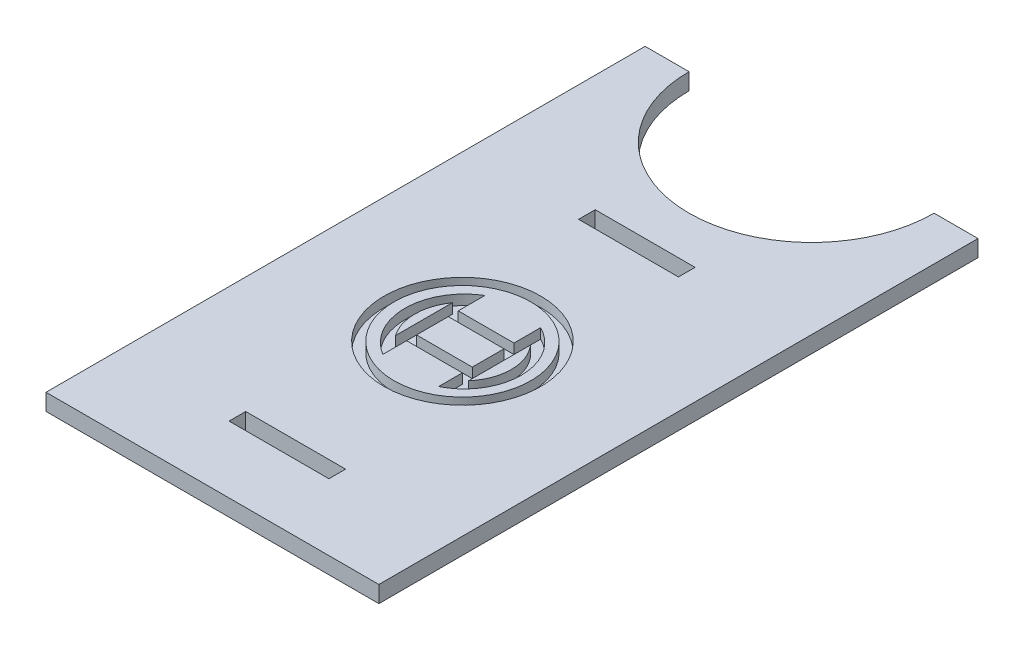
ISO-10303-21;
HEADER;
FILE_DESCRIPTION(('STEP AP214'),'2;1');
FILE_NAME('part.step','',(''),(''),'','','');
FILE_SCHEMA(('AUTOMOTIVE_DESIGN { 1 0 10303 214 1 1 1 1 }'));
ENDSEC;
DATA;
#1=APPLICATION_CONTEXT('core data for automotive mechanical design processes');
#2=APPLICATION_PROTOCOL_DEFINITION('international standard','automotive_design',2000,#1);
#3=PRODUCT_CONTEXT('',#1,'mechanical');
#4=PRODUCT('Part','Part','',(#3));
#5=PRODUCT_RELATED_PRODUCT_CATEGORY('part','',(#4));
#6=PRODUCT_DEFINITION_FORMATION('','',#4);
#7=PRODUCT_DEFINITION_CONTEXT('part definition',#1,'design');
#8=PRODUCT_DEFINITION('design','',#6,#7);
#9=PRODUCT_DEFINITION_SHAPE('','',#8);
#10=(LENGTH_UNIT() NAMED_UNIT(*) SI_UNIT(.MILLI.,.METRE.));
#11=(NAMED_UNIT(*) PLANE_ANGLE_UNIT() SI_UNIT($,.RADIAN.));
#12=(NAMED_UNIT(*) SI_UNIT($,.STERADIAN.) SOLID_ANGLE_UNIT());
#13=UNCERTAINTY_MEASURE_WITH_UNIT(LENGTH_MEASURE(1.E-05),#10,'distance_accuracy_value','');
#14=(GEOMETRIC_REPRESENTATION_CONTEXT(3) GLOBAL_UNCERTAINTY_ASSIGNED_CONTEXT((#13)) GLOBAL_UNIT_ASSIGNED_CONTEXT((#10,
#11,#12)) REPRESENTATION_CONTEXT('',''));
#15=CARTESIAN_POINT('',(0.,0.,0.));
#16=DIRECTION('',(0.,0.,1.));
#17=DIRECTION('',(1.,0.,0.));
#18=AXIS2_PLACEMENT_3D('',#15,#16,#17);
#19=CARTESIAN_POINT('',(0.,5.,0.));
#20=DIRECTION('',(0.,1.,0.));
#21=DIRECTION('',(0.,0.,1.));
#22=AXIS2_PLACEMENT_3D('',#19,#20,#21);
#23=PLANE('',#22);
#24=DIRECTION('',(0.,0.,-1.));
#25=VECTOR('',#24,1.);
#26=CARTESIAN_POINT('',(343.002887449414,5.,0.));
#27=LINE('',#26,#25);
#28=CARTESIAN_POINT('',(343.002887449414,5.,47.8009996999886));
#29=VERTEX_POINT('',#28);
#30=CARTESIAN_POINT('',(343.002887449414,5.,39.7884706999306));
#31=VERTEX_POINT('',#30);
#32=EDGE_CURVE('E322',#29,#31,#27,.T.);
#33=ORIENTED_EDGE('',*,*,#32,.T.);
#34=CARTESIAN_POINT('',(335.371279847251,5.,55.1167205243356));
#35=DIRECTION('',(0.,1.,0.));
#36=DIRECTION('',(0.,0.,1.));
#37=AXIS2_PLACEMENT_3D('',#34,#35,#36);
#38=CIRCLE('',#37,17.122986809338);
#39=CARTESIAN_POINT('',(343.002887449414,5.,70.4449703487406));
#40=VERTEX_POINT('',#39);
#41=EDGE_CURVE('E86',#31,#40,#38,.F.);
#42=ORIENTED_EDGE('',*,*,#41,.T.);
#43=DIRECTION('',(0.,0.,-1.));
#44=VECTOR('',#43,1.);
#45=CARTESIAN_POINT('',(343.002887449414,5.,0.));
#46=LINE('',#45,#44);
#47=CARTESIAN_POINT('',(343.002887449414,5.,63.3253491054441));
#48=VERTEX_POINT('',#47);
#49=EDGE_CURVE('E340',#40,#48,#46,.T.);
#50=ORIENTED_EDGE('',*,*,#49,.T.);
#51=DIRECTION('',(1.,0.,0.));
#52=VECTOR('',#51,1.);
#53=CARTESIAN_POINT('',(0.,5.,63.3253491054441));
#54=LINE('',#53,#52);
#55=CARTESIAN_POINT('',(326.260867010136,5.,63.3253491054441));
#56=VERTEX_POINT('',#55);
#57=EDGE_CURVE('E337',#56,#48,#54,.T.);
#58=ORIENTED_EDGE('',*,*,#57,.F.);
#59=DIRECTION('',(0.,0.,1.));
#60=VECTOR('',#59,1.);
#61=CARTESIAN_POINT('',(326.260867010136,5.,0.));
#62=LINE('',#61,#60);
#63=CARTESIAN_POINT('',(326.260867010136,5.,70.4449703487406));
#64=VERTEX_POINT('',#63);
#65=EDGE_CURVE('E334',#56,#64,#62,.T.);
#66=ORIENTED_EDGE('',*,*,#65,.T.);
#67=CARTESIAN_POINT('',(335.413171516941,5.,55.1167205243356));
#68=DIRECTION('',(0.,1.,0.));
#69=DIRECTION('',(0.,0.,1.));
#70=AXIS2_PLACEMENT_3D('',#67,#68,#69);
#71=CIRCLE('',#70,17.852728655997);
#72=CARTESIAN_POINT('',(326.260867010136,5.,39.7884706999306));
#73=VERTEX_POINT('',#72);
#74=EDGE_CURVE('E331',#73,#64,#71,.T.);
#75=ORIENTED_EDGE('',*,*,#74,.F.);
#76=DIRECTION('',(0.,0.,1.));
#77=VECTOR('',#76,1.);
#78=CARTESIAN_POINT('',(326.260867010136,5.,0.));
#79=LINE('',#78,#77);
#80=CARTESIAN_POINT('',(326.260867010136,5.,47.8009996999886));
#81=VERTEX_POINT('',#80);
#82=EDGE_CURVE('E328',#73,#81,#79,.T.);
#83=ORIENTED_EDGE('',*,*,#82,.T.);
#84=DIRECTION('',(1.,0.,0.));
#85=VECTOR('',#84,1.);
#86=CARTESIAN_POINT('',(0.,5.,47.8009996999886));
#87=LINE('',#86,#85);
#88=EDGE_CURVE('E325',#81,#29,#87,.T.);
#89=ORIENTED_EDGE('',*,*,#88,.T.);
#90=EDGE_LOOP('',(#33,#42,#50,#58,#66,#75,#83,#89));
#91=FACE_BOUND('',#90,.T.);
#92=CARTESIAN_POINT('',(334.807914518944,5.,55.0961913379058));
#93=DIRECTION('',(0.,1.,0.));
#94=DIRECTION('',(0.,0.,1.));
#95=AXIS2_PLACEMENT_3D('',#92,#93,#94);
#96=CIRCLE('',#95,20.5436076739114);
#97=CARTESIAN_POINT('',(334.807914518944,5.,75.6397990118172));
#98=VERTEX_POINT('',#97);
#99=EDGE_CURVE('E359',#98,#98,#96,.T.);
#100=ORIENTED_EDGE('',*,*,#99,.T.);
#101=EDGE_LOOP('',(#100));
#102=FACE_BOUND('',#101,.T.);
#103=ADVANCED_FACE('F61',(#91,#102),#23,.T.);
#104=CARTESIAN_POINT('',(0.,5.,-49.0936382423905));
#105=DIRECTION('',(0.,0.,-1.));
#106=DIRECTION('',(-1.,0.,0.));
#107=AXIS2_PLACEMENT_3D('',#104,#105,#106);
#108=PLANE('',#107);
#109=DIRECTION('',(1.,0.,0.));
#110=VECTOR('',#109,1.);
#111=CARTESIAN_POINT('',(0.,0.,-49.0936382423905));
#112=LINE('',#111,#110);
#113=CARTESIAN_POINT('',(372.331952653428,0.,-49.0936382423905));
#114=VERTEX_POINT('',#113);
#115=CARTESIAN_POINT('',(385.516384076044,0.,-49.0936382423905));
#116=VERTEX_POINT('',#115);
#117=EDGE_CURVE('E459',#114,#116,#112,.T.);
#118=ORIENTED_EDGE('',*,*,#117,.F.);
#119=DIRECTION('',(0.,-1.,0.));
#120=VECTOR('',#119,1.);
#121=CARTESIAN_POINT('',(372.331952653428,5.,-49.0936382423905));
#122=LINE('',#121,#120);
#123=CARTESIAN_POINT('',(372.331952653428,5.,-49.0936382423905));
#124=VERTEX_POINT('',#123);
#125=EDGE_CURVE('E12',#124,#114,#122,.T.);
#126=ORIENTED_EDGE('',*,*,#125,.F.);
#127=DIRECTION('',(1.,0.,0.));
#128=VECTOR('',#127,1.);
#129=CARTESIAN_POINT('',(0.,5.,-49.0936382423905));
#130=LINE('',#129,#128);
#131=CARTESIAN_POINT('',(385.516384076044,5.,-49.0936382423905));
#132=VERTEX_POINT('',#131);
#133=EDGE_CURVE('E422',#124,#132,#130,.T.);
#134=ORIENTED_EDGE('',*,*,#133,.T.);
#135=DIRECTION('',(0.,-1.,0.));
#136=VECTOR('',#135,1.);
#137=CARTESIAN_POINT('',(385.516384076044,5.,-49.0936382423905));
#138=LINE('',#137,#136);
#139=EDGE_CURVE('E476',#132,#116,#138,.T.);
#140=ORIENTED_EDGE('',*,*,#139,.T.);
#141=EDGE_LOOP('',(#118,#126,#134,#140));
#142=FACE_BOUND('',#141,.T.);
#143=ADVANCED_FACE('F541',(#142),#108,.T.);
#144=CARTESIAN_POINT('',(335.516384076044,5.,-49.0936382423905));
#145=DIRECTION('',(0.,-1.,0.));
#146=DIRECTION('',(0.,0.,-1.));
#147=AXIS2_PLACEMENT_3D('',#144,#145,#146);
#148=CYLINDRICAL_SURFACE('',#147,36.8155685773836);
#149=CARTESIAN_POINT('',(335.516384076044,0.,-49.0936382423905));
#150=DIRECTION('',(0.,1.,0.));
#151=DIRECTION('',(0.,0.,1.));
#152=AXIS2_PLACEMENT_3D('',#149,#150,#151);
#153=CIRCLE('',#152,36.8155685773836);
#154=CARTESIAN_POINT('',(298.700815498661,0.,-49.0936382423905));
#155=VERTEX_POINT('',#154);
#156=EDGE_CURVE('E462',#114,#155,#153,.F.);
#157=ORIENTED_EDGE('',*,*,#156,.T.);
#158=DIRECTION('',(0.,-1.,0.));
#159=VECTOR('',#158,1.);
#160=CARTESIAN_POINT('',(298.700815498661,5.,-49.0936382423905));
#161=LINE('',#160,#159);
#162=CARTESIAN_POINT('',(298.700815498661,5.,-49.0936382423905));
#163=VERTEX_POINT('',#162);
#164=EDGE_CURVE('E70',#163,#155,#161,.T.);
#165=ORIENTED_EDGE('',*,*,#164,.F.);
#166=CARTESIAN_POINT('',(335.516384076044,5.,-49.0936382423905));
#167=DIRECTION('',(0.,1.,0.));
#168=DIRECTION('',(0.,0.,1.));
#169=AXIS2_PLACEMENT_3D('',#166,#167,#168);
#170=CIRCLE('',#169,36.8155685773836);
#171=EDGE_CURVE('E425',#124,#163,#170,.F.);
#172=ORIENTED_EDGE('',*,*,#171,.F.);
#173=ORIENTED_EDGE('',*,*,#125,.T.);
#174=EDGE_LOOP('',(#157,#165,#172,#173));
#175=FACE_BOUND('',#174,.T.);
#176=ADVANCED_FACE('F544',(#175),#148,.F.);
#177=CARTESIAN_POINT('',(0.,5.,-49.0936382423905));
#178=DIRECTION('',(0.,0.,-1.));
#179=DIRECTION('',(-1.,0.,0.));
#180=AXIS2_PLACEMENT_3D('',#177,#178,#179);
#181=PLANE('',#180);
#182=DIRECTION('',(1.,0.,0.));
#183=VECTOR('',#182,1.);
#184=CARTESIAN_POINT('',(0.,0.,-49.0936382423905));
#185=LINE('',#184,#183);
#186=CARTESIAN_POINT('',(285.516384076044,0.,-49.0936382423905));
#187=VERTEX_POINT('',#186);
#188=EDGE_CURVE('E465',#187,#155,#185,.T.);
#189=ORIENTED_EDGE('',*,*,#188,.F.);
#190=DIRECTION('',(0.,-1.,0.));
#191=VECTOR('',#190,1.);
#192=CARTESIAN_POINT('',(285.516384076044,5.,-49.0936382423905));
#193=LINE('',#192,#191);
#194=CARTESIAN_POINT('',(285.516384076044,5.,-49.0936382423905));
#195=VERTEX_POINT('',#194);
#196=EDGE_CURVE('E484',#195,#187,#193,.T.);
#197=ORIENTED_EDGE('',*,*,#196,.F.);
#198=DIRECTION('',(1.,0.,0.));
#199=VECTOR('',#198,1.);
#200=CARTESIAN_POINT('',(0.,5.,-49.0936382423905));
#201=LINE('',#200,#199);
#202=EDGE_CURVE('E427',#195,#163,#201,.T.);
#203=ORIENTED_EDGE('',*,*,#202,.T.);
#204=ORIENTED_EDGE('',*,*,#164,.T.);
#205=EDGE_LOOP('',(#189,#197,#203,#204));
#206=FACE_BOUND('',#205,.T.);
#207=ADVANCED_FACE('F547',(#206),#181,.T.);
#208=CARTESIAN_POINT('',(285.516384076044,5.,0.));
#209=DIRECTION('',(-1.,0.,0.));
#210=DIRECTION('',(0.,0.,1.));
#211=AXIS2_PLACEMENT_3D('',#208,#209,#210);
#212=PLANE('',#211);
#213=DIRECTION('',(0.,0.,-1.));
#214=VECTOR('',#213,1.);
#215=CARTESIAN_POINT('',(285.516384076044,0.,0.));
#216=LINE('',#215,#214);
#217=CARTESIAN_POINT('',(285.516384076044,0.,130.90636175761));
#218=VERTEX_POINT('',#217);
#219=EDGE_CURVE('E468',#218,#187,#216,.T.);
#220=ORIENTED_EDGE('',*,*,#219,.F.);
#221=DIRECTION('',(0.,-1.,0.));
#222=VECTOR('',#221,1.);
#223=CARTESIAN_POINT('',(285.516384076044,5.,130.90636175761));
#224=LINE('',#223,#222);
#225=CARTESIAN_POINT('',(285.516384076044,5.,130.90636175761));
#226=VERTEX_POINT('',#225);
#227=EDGE_CURVE('E482',#226,#218,#224,.T.);
#228=ORIENTED_EDGE('',*,*,#227,.F.);
#229=DIRECTION('',(0.,0.,-1.));
#230=VECTOR('',#229,1.);
#231=CARTESIAN_POINT('',(285.516384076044,5.,0.));
#232=LINE('',#231,#230);
#233=EDGE_CURVE('E430',#226,#195,#232,.T.);
#234=ORIENTED_EDGE('',*,*,#233,.T.);
#235=ORIENTED_EDGE('',*,*,#196,.T.);
#236=EDGE_LOOP('',(#220,#228,#234,#235));
#237=FACE_BOUND('',#236,.T.);
#238=ADVANCED_FACE('F551',(#237),#212,.T.);
#239=CARTESIAN_POINT('',(0.,5.,130.90636175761));
#240=DIRECTION('',(0.,0.,-1.));
#241=DIRECTION('',(-1.,0.,0.));
#242=AXIS2_PLACEMENT_3D('',#239,#240,#241);
#243=PLANE('',#242);
#244=DIRECTION('',(1.,0.,0.));
#245=VECTOR('',#244,1.);
#246=CARTESIAN_POINT('',(0.,0.,130.90636175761));
#247=LINE('',#246,#245);
#248=CARTESIAN_POINT('',(385.516384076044,0.,130.90636175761));
#249=VERTEX_POINT('',#248);
#250=EDGE_CURVE('E471',#218,#249,#247,.T.);
#251=ORIENTED_EDGE('',*,*,#250,.T.);
#252=DIRECTION('',(0.,-1.,0.));
#253=VECTOR('',#252,1.);
#254=CARTESIAN_POINT('',(385.516384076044,5.,130.90636175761));
#255=LINE('',#254,#253);
#256=CARTESIAN_POINT('',(385.516384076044,5.,130.90636175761));
#257=VERTEX_POINT('',#256);
#258=EDGE_CURVE('E478',#257,#249,#255,.T.);
#259=ORIENTED_EDGE('',*,*,#258,.F.);
#260=DIRECTION('',(1.,0.,0.));
#261=VECTOR('',#260,1.);
#262=CARTESIAN_POINT('',(0.,5.,130.90636175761));
#263=LINE('',#262,#261);
#264=EDGE_CURVE('E433',#226,#257,#263,.T.);
#265=ORIENTED_EDGE('',*,*,#264,.F.);
#266=ORIENTED_EDGE('',*,*,#227,.T.);
#267=EDGE_LOOP('',(#251,#259,#265,#266));
#268=FACE_BOUND('',#267,.T.);
#269=ADVANCED_FACE('F556',(#268),#243,.F.);
#270=CARTESIAN_POINT('',(320.516384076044,5.,0.));
#271=DIRECTION('',(1.,0.,0.));
#272=DIRECTION('',(0.,0.,-1.));
#273=AXIS2_PLACEMENT_3D('',#270,#271,#272);
#274=PLANE('',#273);
#275=DIRECTION('',(0.,0.,1.));
#276=VECTOR('',#275,1.);
#277=CARTESIAN_POINT('',(320.516384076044,0.,0.));
#278=LINE('',#277,#276);
#279=CARTESIAN_POINT('',(320.516384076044,0.,105.90636175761));
#280=VERTEX_POINT('',#279);
#281=CARTESIAN_POINT('',(320.516384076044,0.,110.90636175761));
#282=VERTEX_POINT('',#281);
#283=EDGE_CURVE('E447',#280,#282,#278,.T.);
#284=ORIENTED_EDGE('',*,*,#283,.F.);
#285=DIRECTION('',(0.,-1.,0.));
#286=VECTOR('',#285,1.);
#287=CARTESIAN_POINT('',(320.516384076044,5.,105.90636175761));
#288=LINE('',#287,#286);
#289=CARTESIAN_POINT('',(320.516384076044,5.,105.90636175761));
#290=VERTEX_POINT('',#289);
#291=EDGE_CURVE('E479',#290,#280,#288,.T.);
#292=ORIENTED_EDGE('',*,*,#291,.F.);
#293=DIRECTION('',(0.,0.,1.));
#294=VECTOR('',#293,1.);
#295=CARTESIAN_POINT('',(320.516384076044,5.,0.));
#296=LINE('',#295,#294);
#297=CARTESIAN_POINT('',(320.516384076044,5.,110.90636175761));
#298=VERTEX_POINT('',#297);
#299=EDGE_CURVE('E410',#290,#298,#296,.T.);
#300=ORIENTED_EDGE('',*,*,#299,.T.);
#301=DIRECTION('',(0.,-1.,0.));
#302=VECTOR('',#301,1.);
#303=CARTESIAN_POINT('',(320.516384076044,5.,110.90636175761));
#304=LINE('',#303,#302);
#305=EDGE_CURVE('E487',#298,#282,#304,.T.);
#306=ORIENTED_EDGE('',*,*,#305,.T.);
#307=EDGE_LOOP('',(#284,#292,#300,#306));
#308=FACE_BOUND('',#307,.T.);
#309=ADVANCED_FACE('F863',(#308),#274,.T.);
#310=CARTESIAN_POINT('',(0.,5.,105.90636175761));
#311=DIRECTION('',(0.,0.,1.));
#312=DIRECTION('',(1.,0.,0.));
#313=AXIS2_PLACEMENT_3D('',#310,#311,#312);
#314=PLANE('',#313);
#315=DIRECTION('',(-1.,0.,0.));
#316=VECTOR('',#315,1.);
#317=CARTESIAN_POINT('',(0.,0.,105.90636175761));
#318=LINE('',#317,#316);
#319=CARTESIAN_POINT('',(350.516384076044,0.,105.90636175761));
#320=VERTEX_POINT('',#319);
#321=EDGE_CURVE('E450',#320,#280,#318,.T.);
#322=ORIENTED_EDGE('',*,*,#321,.F.);
#323=DIRECTION('',(0.,-1.,0.));
#324=VECTOR('',#323,1.);
#325=CARTESIAN_POINT('',(350.516384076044,5.,105.90636175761));
#326=LINE('',#325,#324);
#327=CARTESIAN_POINT('',(350.516384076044,5.,105.90636175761));
#328=VERTEX_POINT('',#327);
#329=EDGE_CURVE('E491',#328,#320,#326,.T.);
#330=ORIENTED_EDGE('',*,*,#329,.F.);
#331=DIRECTION('',(-1.,0.,0.));
#332=VECTOR('',#331,1.);
#333=CARTESIAN_POINT('',(0.,5.,105.90636175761));
#334=LINE('',#333,#332);
#335=EDGE_CURVE('E413',#328,#290,#334,.T.);
#336=ORIENTED_EDGE('',*,*,#335,.T.);
#337=ORIENTED_EDGE('',*,*,#291,.T.);
#338=EDGE_LOOP('',(#322,#330,#336,#337));
#339=FACE_BOUND('',#338,.T.);
#340=ADVANCED_FACE('F855',(#339),#314,.T.);
#341=CARTESIAN_POINT('',(350.516384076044,5.,0.));
#342=DIRECTION('',(-1.,0.,0.));
#343=DIRECTION('',(0.,0.,1.));
#344=AXIS2_PLACEMENT_3D('',#341,#342,#343);
#345=PLANE('',#344);
#346=DIRECTION('',(0.,0.,-1.));
#347=VECTOR('',#346,1.);
#348=CARTESIAN_POINT('',(350.516384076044,0.,0.));
#349=LINE('',#348,#347);
#350=CARTESIAN_POINT('',(350.516384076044,0.,110.90636175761));
#351=VERTEX_POINT('',#350);
#352=EDGE_CURVE('E453',#351,#320,#349,.T.);
#353=ORIENTED_EDGE('',*,*,#352,.F.);
#354=DIRECTION('',(0.,-1.,0.));
#355=VECTOR('',#354,1.);
#356=CARTESIAN_POINT('',(350.516384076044,5.,110.90636175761));
#357=LINE('',#356,#355);
#358=CARTESIAN_POINT('',(350.516384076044,5.,110.90636175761));
#359=VERTEX_POINT('',#358);
#360=EDGE_CURVE('E489',#359,#351,#357,.T.);
#361=ORIENTED_EDGE('',*,*,#360,.F.);
#362=DIRECTION('',(0.,0.,-1.));
#363=VECTOR('',#362,1.);
#364=CARTESIAN_POINT('',(350.516384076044,5.,0.));
#365=LINE('',#364,#363);
#366=EDGE_CURVE('E416',#359,#328,#365,.T.);
#367=ORIENTED_EDGE('',*,*,#366,.T.);
#368=ORIENTED_EDGE('',*,*,#329,.T.);
#369=EDGE_LOOP('',(#353,#361,#367,#368));
#370=FACE_BOUND('',#369,.T.);
#371=ADVANCED_FACE('F849',(#370),#345,.T.);
#372=CARTESIAN_POINT('',(320.516384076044,5.,0.));
#373=DIRECTION('',(-1.,0.,0.));
#374=DIRECTION('',(0.,0.,1.));
#375=AXIS2_PLACEMENT_3D('',#372,#373,#374);
#376=PLANE('',#375);
#377=DIRECTION('',(0.,0.,-1.));
#378=VECTOR('',#377,1.);
#379=CARTESIAN_POINT('',(320.516384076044,0.,0.));
#380=LINE('',#379,#378);
#381=CARTESIAN_POINT('',(320.516384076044,0.,5.90636175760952));
#382=VERTEX_POINT('',#381);
#383=CARTESIAN_POINT('',(320.516384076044,0.,0.906361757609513));
#384=VERTEX_POINT('',#383);
#385=EDGE_CURVE('E395',#382,#384,#380,.T.);
#386=ORIENTED_EDGE('',*,*,#385,.T.);
#387=DIRECTION('',(0.,-1.,0.));
#388=VECTOR('',#387,1.);
#389=CARTESIAN_POINT('',(320.516384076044,5.,0.906361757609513));
#390=LINE('',#389,#388);
#391=CARTESIAN_POINT('',(320.516384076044,5.,0.906361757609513));
#392=VERTEX_POINT('',#391);
#393=EDGE_CURVE('E65',#392,#384,#390,.T.);
#394=ORIENTED_EDGE('',*,*,#393,.F.);
#395=DIRECTION('',(0.,0.,-1.));
#396=VECTOR('',#395,1.);
#397=CARTESIAN_POINT('',(320.516384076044,5.,0.));
#398=LINE('',#397,#396);
#399=CARTESIAN_POINT('',(320.516384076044,5.,5.90636175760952));
#400=VERTEX_POINT('',#399);
#401=EDGE_CURVE('E400',#400,#392,#398,.T.);
#402=ORIENTED_EDGE('',*,*,#401,.F.);
#403=DIRECTION('',(0.,-1.,0.));
#404=VECTOR('',#403,1.);
#405=CARTESIAN_POINT('',(320.516384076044,5.,5.90636175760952));
#406=LINE('',#405,#404);
#407=EDGE_CURVE('E438',#400,#382,#406,.T.);
#408=ORIENTED_EDGE('',*,*,#407,.T.);
#409=EDGE_LOOP('',(#386,#394,#402,#408));
#410=FACE_BOUND('',#409,.T.);
#411=ADVANCED_FACE('F63',(#410),#376,.F.);
#412=CARTESIAN_POINT('',(0.,5.,0.906361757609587));
#413=DIRECTION('',(0.,0.,-1.));
#414=DIRECTION('',(-1.,0.,0.));
#415=AXIS2_PLACEMENT_3D('',#412,#413,#414);
#416=PLANE('',#415);
#417=DIRECTION('',(1.,0.,0.));
#418=VECTOR('',#417,1.);
#419=CARTESIAN_POINT('',(0.,0.,0.906361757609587));
#420=LINE('',#419,#418);
#421=CARTESIAN_POINT('',(350.516384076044,0.,0.906361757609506));
#422=VERTEX_POINT('',#421);
#423=EDGE_CURVE('E441',#384,#422,#420,.T.);
#424=ORIENTED_EDGE('',*,*,#423,.T.);
#425=DIRECTION('',(0.,-1.,0.));
#426=VECTOR('',#425,1.);
#427=CARTESIAN_POINT('',(350.516384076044,5.,0.906361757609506));
#428=LINE('',#427,#426);
#429=CARTESIAN_POINT('',(350.516384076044,5.,0.906361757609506));
#430=VERTEX_POINT('',#429);
#431=EDGE_CURVE('E498',#430,#422,#428,.T.);
#432=ORIENTED_EDGE('',*,*,#431,.F.);
#433=DIRECTION('',(1.,0.,0.));
#434=VECTOR('',#433,1.);
#435=CARTESIAN_POINT('',(0.,5.,0.906361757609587));
#436=LINE('',#435,#434);
#437=EDGE_CURVE('E403',#392,#430,#436,.T.);
#438=ORIENTED_EDGE('',*,*,#437,.F.);
#439=ORIENTED_EDGE('',*,*,#393,.T.);
#440=EDGE_LOOP('',(#424,#432,#438,#439));
#441=FACE_BOUND('',#440,.T.);
#442=ADVANCED_FACE('F507',(#441),#416,.F.);
#443=CARTESIAN_POINT('',(350.516384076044,5.,0.));
#444=DIRECTION('',(1.,0.,0.));
#445=DIRECTION('',(0.,0.,-1.));
#446=AXIS2_PLACEMENT_3D('',#443,#444,#445);
#447=PLANE('',#446);
#448=DIRECTION('',(0.,0.,1.));
#449=VECTOR('',#448,1.);
#450=CARTESIAN_POINT('',(350.516384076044,0.,0.));
#451=LINE('',#450,#449);
#452=CARTESIAN_POINT('',(350.516384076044,0.,5.90636175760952));
#453=VERTEX_POINT('',#452);
#454=EDGE_CURVE('E443',#422,#453,#451,.T.);
#455=ORIENTED_EDGE('',*,*,#454,.T.);
#456=DIRECTION('',(0.,-1.,0.));
#457=VECTOR('',#456,1.);
#458=CARTESIAN_POINT('',(350.516384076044,5.,5.90636175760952));
#459=LINE('',#458,#457);
#460=CARTESIAN_POINT('',(350.516384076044,5.,5.90636175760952));
#461=VERTEX_POINT('',#460);
#462=EDGE_CURVE('E496',#461,#453,#459,.T.);
#463=ORIENTED_EDGE('',*,*,#462,.F.);
#464=DIRECTION('',(0.,0.,1.));
#465=VECTOR('',#464,1.);
#466=CARTESIAN_POINT('',(350.516384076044,5.,0.));
#467=LINE('',#466,#465);
#468=EDGE_CURVE('E406',#430,#461,#467,.T.);
#469=ORIENTED_EDGE('',*,*,#468,.F.);
#470=ORIENTED_EDGE('',*,*,#431,.T.);
#471=EDGE_LOOP('',(#455,#463,#469,#470));
#472=FACE_BOUND('',#471,.T.);
#473=ADVANCED_FACE('F517',(#472),#447,.F.);
#474=CARTESIAN_POINT('',(0.,5.,110.90636175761));
#475=DIRECTION('',(0.,0.,-1.));
#476=DIRECTION('',(-1.,0.,0.));
#477=AXIS2_PLACEMENT_3D('',#474,#475,#476);
#478=PLANE('',#477);
#479=DIRECTION('',(1.,0.,0.));
#480=VECTOR('',#479,1.);
#481=CARTESIAN_POINT('',(0.,0.,110.90636175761));
#482=LINE('',#481,#480);
#483=EDGE_CURVE('E456',#282,#351,#482,.T.);
#484=ORIENTED_EDGE('',*,*,#483,.F.);
#485=ORIENTED_EDGE('',*,*,#305,.F.);
#486=DIRECTION('',(1.,0.,0.));
#487=VECTOR('',#486,1.);
#488=CARTESIAN_POINT('',(0.,5.,110.90636175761));
#489=LINE('',#488,#487);
#490=EDGE_CURVE('E419',#298,#359,#489,.T.);
#491=ORIENTED_EDGE('',*,*,#490,.T.);
#492=ORIENTED_EDGE('',*,*,#360,.T.);
#493=EDGE_LOOP('',(#484,#485,#491,#492));
#494=FACE_BOUND('',#493,.T.);
#495=ADVANCED_FACE('F824',(#494),#478,.T.);
#496=CARTESIAN_POINT('',(0.,5.,5.90636175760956));
#497=DIRECTION('',(0.,0.,1.));
#498=DIRECTION('',(1.,0.,0.));
#499=AXIS2_PLACEMENT_3D('',#496,#497,#498);
#500=PLANE('',#499);
#501=DIRECTION('',(-1.,0.,0.));
#502=VECTOR('',#501,1.);
#503=CARTESIAN_POINT('',(0.,0.,5.90636175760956));
#504=LINE('',#503,#502);
#505=EDGE_CURVE('E445',#453,#382,#504,.T.);
#506=ORIENTED_EDGE('',*,*,#505,.T.);
#507=ORIENTED_EDGE('',*,*,#407,.F.);
#508=DIRECTION('',(-1.,0.,0.));
#509=VECTOR('',#508,1.);
#510=CARTESIAN_POINT('',(0.,5.,5.90636175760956));
#511=LINE('',#510,#509);
#512=EDGE_CURVE('E408',#461,#400,#511,.T.);
#513=ORIENTED_EDGE('',*,*,#512,.F.);
#514=ORIENTED_EDGE('',*,*,#462,.T.);
#515=EDGE_LOOP('',(#506,#507,#513,#514));
#516=FACE_BOUND('',#515,.T.);
#517=ADVANCED_FACE('F520',(#516),#500,.F.);
#518=CARTESIAN_POINT('',(385.516384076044,5.,0.));
#519=DIRECTION('',(-1.,0.,0.));
#520=DIRECTION('',(0.,0.,1.));
#521=AXIS2_PLACEMENT_3D('',#518,#519,#520);
#522=PLANE('',#521);
#523=DIRECTION('',(0.,0.,-1.));
#524=VECTOR('',#523,1.);
#525=CARTESIAN_POINT('',(385.516384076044,0.,0.));
#526=LINE('',#525,#524);
#527=EDGE_CURVE('E404',#249,#116,#526,.T.);
#528=ORIENTED_EDGE('',*,*,#527,.T.);
#529=ORIENTED_EDGE('',*,*,#139,.F.);
#530=DIRECTION('',(0.,0.,-1.));
#531=VECTOR('',#530,1.);
#532=CARTESIAN_POINT('',(385.516384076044,5.,0.));
#533=LINE('',#532,#531);
#534=EDGE_CURVE('E436',#257,#132,#533,.T.);
#535=ORIENTED_EDGE('',*,*,#534,.F.);
#536=ORIENTED_EDGE('',*,*,#258,.T.);
#537=EDGE_LOOP('',(#528,#529,#535,#536));
#538=FACE_BOUND('',#537,.T.);
#539=ADVANCED_FACE('F525',(#538),#522,.F.);
#540=CARTESIAN_POINT('',(334.807914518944,5.,55.0961913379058));
#541=DIRECTION('',(0.,1.,0.));
#542=DIRECTION('',(0.,0.,1.));
#543=AXIS2_PLACEMENT_3D('',#540,#541,#542);
#544=CIRCLE('',#543,23.5436076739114);
#545=CARTESIAN_POINT('',(334.807914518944,5.,78.6397990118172));
#546=VERTEX_POINT('',#545);
#547=EDGE_CURVE('E392',#546,#546,#544,.T.);
#548=ORIENTED_EDGE('',*,*,#547,.F.);
#549=EDGE_LOOP('',(#548));
#550=FACE_BOUND('',#549,.T.);
#551=ORIENTED_EDGE('',*,*,#401,.T.);
#552=ORIENTED_EDGE('',*,*,#437,.T.);
#553=ORIENTED_EDGE('',*,*,#468,.T.);
#554=ORIENTED_EDGE('',*,*,#512,.T.);
#555=EDGE_LOOP('',(#551,#552,#553,#554));
#556=FACE_BOUND('',#555,.T.);
#557=ORIENTED_EDGE('',*,*,#299,.F.);
#558=ORIENTED_EDGE('',*,*,#335,.F.);
#559=ORIENTED_EDGE('',*,*,#366,.F.);
#560=ORIENTED_EDGE('',*,*,#490,.F.);
#561=EDGE_LOOP('',(#557,#558,#559,#560));
#562=FACE_BOUND('',#561,.T.);
#563=ORIENTED_EDGE('',*,*,#133,.F.);
#564=ORIENTED_EDGE('',*,*,#171,.T.);
#565=ORIENTED_EDGE('',*,*,#202,.F.);
#566=ORIENTED_EDGE('',*,*,#233,.F.);
#567=ORIENTED_EDGE('',*,*,#264,.T.);
#568=ORIENTED_EDGE('',*,*,#534,.T.);
#569=EDGE_LOOP('',(#563,#564,#565,#566,#567,#568));
#570=FACE_BOUND('',#569,.T.);
#571=ADVANCED_FACE('F522',(#550,#556,#562,#570),#23,.T.);
#572=CARTESIAN_POINT('',(0.,0.,0.));
#573=DIRECTION('',(0.,1.,0.));
#574=DIRECTION('',(0.,0.,1.));
#575=AXIS2_PLACEMENT_3D('',#572,#573,#574);
#576=PLANE('',#575);
#577=ORIENTED_EDGE('',*,*,#385,.F.);
#578=ORIENTED_EDGE('',*,*,#505,.F.);
#579=ORIENTED_EDGE('',*,*,#454,.F.);
#580=ORIENTED_EDGE('',*,*,#423,.F.);
#581=EDGE_LOOP('',(#577,#578,#579,#580));
#582=FACE_BOUND('',#581,.T.);
#583=ORIENTED_EDGE('',*,*,#283,.T.);
#584=ORIENTED_EDGE('',*,*,#483,.T.);
#585=ORIENTED_EDGE('',*,*,#352,.T.);
#586=ORIENTED_EDGE('',*,*,#321,.T.);
#587=EDGE_LOOP('',(#583,#584,#585,#586));
#588=FACE_BOUND('',#587,.T.);
#589=ORIENTED_EDGE('',*,*,#117,.T.);
#590=ORIENTED_EDGE('',*,*,#527,.F.);
#591=ORIENTED_EDGE('',*,*,#250,.F.);
#592=ORIENTED_EDGE('',*,*,#219,.T.);
#593=ORIENTED_EDGE('',*,*,#188,.T.);
#594=ORIENTED_EDGE('',*,*,#156,.F.);
#595=EDGE_LOOP('',(#589,#590,#591,#592,#593,#594));
#596=FACE_BOUND('',#595,.T.);
#597=ADVANCED_FACE('F514',(#582,#588,#596),#576,.F.);
#598=CARTESIAN_POINT('',(334.807914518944,2.,55.0961913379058));
#599=DIRECTION('',(0.,1.,0.));
#600=DIRECTION('',(0.,0.,1.));
#601=AXIS2_PLACEMENT_3D('',#598,#599,#600);
#602=CYLINDRICAL_SURFACE('',#601,20.5436076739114);
#603=CARTESIAN_POINT('',(334.807914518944,2.,55.0961913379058));
#604=DIRECTION('',(0.,1.,0.));
#605=DIRECTION('',(0.,0.,1.));
#606=AXIS2_PLACEMENT_3D('',#603,#604,#605);
#607=CIRCLE('',#606,20.5436076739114);
#608=CARTESIAN_POINT('',(334.807914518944,2.,75.6397990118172));
#609=VERTEX_POINT('',#608);
#610=EDGE_CURVE('E388',#609,#609,#607,.T.);
#611=ORIENTED_EDGE('',*,*,#610,.T.);
#612=EDGE_LOOP('',(#611));
#613=FACE_BOUND('',#612,.T.);
#614=ORIENTED_EDGE('',*,*,#99,.F.);
#615=EDGE_LOOP('',(#614));
#616=FACE_BOUND('',#615,.T.);
#617=ADVANCED_FACE('F560',(#613,#616),#602,.T.);
#618=CARTESIAN_POINT('',(334.807914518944,2.,55.0961913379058));
#619=DIRECTION('',(0.,1.,0.));
#620=DIRECTION('',(0.,0.,1.));
#621=AXIS2_PLACEMENT_3D('',#618,#619,#620);
#622=CYLINDRICAL_SURFACE('',#621,23.5436076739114);
#623=CARTESIAN_POINT('',(334.807914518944,2.,55.0961913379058));
#624=DIRECTION('',(0.,1.,0.));
#625=DIRECTION('',(0.,0.,1.));
#626=AXIS2_PLACEMENT_3D('',#623,#624,#625);
#627=CIRCLE('',#626,23.5436076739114);
#628=CARTESIAN_POINT('',(334.807914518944,2.,78.6397990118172));
#629=VERTEX_POINT('',#628);
#630=EDGE_CURVE('E391',#629,#629,#627,.T.);
#631=ORIENTED_EDGE('',*,*,#630,.F.);
#632=EDGE_LOOP('',(#631));
#633=FACE_BOUND('',#632,.T.);
#634=ORIENTED_EDGE('',*,*,#547,.T.);
#635=EDGE_LOOP('',(#634));
#636=FACE_BOUND('',#635,.T.);
#637=ADVANCED_FACE('F565',(#633,#636),#622,.F.);
#638=CARTESIAN_POINT('',(0.,2.,0.));
#639=DIRECTION('',(0.,1.,0.));
#640=DIRECTION('',(0.,0.,1.));
#641=AXIS2_PLACEMENT_3D('',#638,#639,#640);
#642=PLANE('',#641);
#643=ORIENTED_EDGE('',*,*,#610,.F.);
#644=EDGE_LOOP('',(#643));
#645=FACE_BOUND('',#644,.T.);
#646=ORIENTED_EDGE('',*,*,#630,.T.);
#647=EDGE_LOOP('',(#646));
#648=FACE_BOUND('',#647,.T.);
#649=ADVANCED_FACE('F652',(#645,#648),#642,.T.);
#650=CARTESIAN_POINT('',(346.002887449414,2.,0.));
#651=DIRECTION('',(1.,0.,0.));
#652=DIRECTION('',(0.,0.,-1.));
#653=AXIS2_PLACEMENT_3D('',#650,#651,#652);
#654=PLANE('',#653);
#655=DIRECTION('',(0.,0.,-1.));
#656=VECTOR('',#655,1.);
#657=CARTESIAN_POINT('',(346.002887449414,5.,0.));
#658=LINE('',#657,#656);
#659=CARTESIAN_POINT('',(346.002887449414,5.,64.4133691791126));
#660=VERTEX_POINT('',#659);
#661=CARTESIAN_POINT('',(346.002887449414,5.,45.8200718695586));
#662=VERTEX_POINT('',#661);
#663=EDGE_CURVE('E353',#660,#662,#658,.T.);
#664=ORIENTED_EDGE('',*,*,#663,.T.);
#665=DIRECTION('',(0.,1.,0.));
#666=VECTOR('',#665,1.);
#667=CARTESIAN_POINT('',(346.002887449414,2.,45.8200718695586));
#668=LINE('',#667,#666);
#669=CARTESIAN_POINT('',(346.002887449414,2.,45.8200718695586));
#670=VERTEX_POINT('',#669);
#671=EDGE_CURVE('E360',#670,#662,#668,.T.);
#672=ORIENTED_EDGE('',*,*,#671,.F.);
#673=DIRECTION('',(0.,0.,-1.));
#674=VECTOR('',#673,1.);
#675=CARTESIAN_POINT('',(346.002887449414,2.,0.));
#676=LINE('',#675,#674);
#677=CARTESIAN_POINT('',(346.002887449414,2.,64.4133691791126));
#678=VERTEX_POINT('',#677);
#679=EDGE_CURVE('E313',#678,#670,#676,.T.);
#680=ORIENTED_EDGE('',*,*,#679,.F.);
#681=DIRECTION('',(0.,1.,0.));
#682=VECTOR('',#681,1.);
#683=CARTESIAN_POINT('',(346.002887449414,2.,64.4133691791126));
#684=LINE('',#683,#682);
#685=EDGE_CURVE('E357',#678,#660,#684,.T.);
#686=ORIENTED_EDGE('',*,*,#685,.T.);
#687=EDGE_LOOP('',(#664,#672,#680,#686));
#688=FACE_BOUND('',#687,.T.);
#689=ADVANCED_FACE('F620',(#688),#654,.F.);
#690=CARTESIAN_POINT('',(343.002887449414,2.,0.));
#691=DIRECTION('',(1.,0.,0.));
#692=DIRECTION('',(0.,0.,-1.));
#693=AXIS2_PLACEMENT_3D('',#690,#691,#692);
#694=PLANE('',#693);
#695=DIRECTION('',(0.,0.,-1.));
#696=VECTOR('',#695,1.);
#697=CARTESIAN_POINT('',(343.002887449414,5.,0.));
#698=LINE('',#697,#696);
#699=CARTESIAN_POINT('',(343.002887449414,5.,60.3253491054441));
#700=VERTEX_POINT('',#699);
#701=CARTESIAN_POINT('',(343.002887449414,5.,50.8009996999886));
#702=VERTEX_POINT('',#701);
#703=EDGE_CURVE('E78',#700,#702,#698,.T.);
#704=ORIENTED_EDGE('',*,*,#703,.F.);
#705=DIRECTION('',(0.,1.,0.));
#706=VECTOR('',#705,1.);
#707=CARTESIAN_POINT('',(343.002887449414,2.,60.3253491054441));
#708=LINE('',#707,#706);
#709=CARTESIAN_POINT('',(343.002887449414,2.,60.3253491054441));
#710=VERTEX_POINT('',#709);
#711=EDGE_CURVE('E369',#710,#700,#708,.T.);
#712=ORIENTED_EDGE('',*,*,#711,.F.);
#713=DIRECTION('',(0.,0.,-1.));
#714=VECTOR('',#713,1.);
#715=CARTESIAN_POINT('',(343.002887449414,2.,0.));
#716=LINE('',#715,#714);
#717=CARTESIAN_POINT('',(343.002887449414,2.,50.8009996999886));
#718=VERTEX_POINT('',#717);
#719=EDGE_CURVE('E304',#710,#718,#716,.T.);
#720=ORIENTED_EDGE('',*,*,#719,.T.);
#721=DIRECTION('',(0.,1.,0.));
#722=VECTOR('',#721,1.);
#723=CARTESIAN_POINT('',(343.002887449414,2.,50.8009996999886));
#724=LINE('',#723,#722);
#725=EDGE_CURVE('E363',#718,#702,#724,.T.);
#726=ORIENTED_EDGE('',*,*,#725,.T.);
#727=EDGE_LOOP('',(#704,#712,#720,#726));
#728=FACE_BOUND('',#727,.T.);
#729=ADVANCED_FACE('F593',(#728),#694,.T.);
#730=CARTESIAN_POINT('',(0.,2.,50.8009996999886));
#731=DIRECTION('',(0.,0.,1.));
#732=DIRECTION('',(1.,0.,0.));
#733=AXIS2_PLACEMENT_3D('',#730,#731,#732);
#734=PLANE('',#733);
#735=DIRECTION('',(1.,0.,0.));
#736=VECTOR('',#735,1.);
#737=CARTESIAN_POINT('',(0.,5.,50.8009996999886));
#738=LINE('',#737,#736);
#739=CARTESIAN_POINT('',(326.260867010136,5.,50.8009996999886));
#740=VERTEX_POINT('',#739);
#741=EDGE_CURVE('E350',#740,#702,#738,.T.);
#742=ORIENTED_EDGE('',*,*,#741,.T.);
#743=ORIENTED_EDGE('',*,*,#725,.F.);
#744=DIRECTION('',(1.,0.,0.));
#745=VECTOR('',#744,1.);
#746=CARTESIAN_POINT('',(0.,2.,50.8009996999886));
#747=LINE('',#746,#745);
#748=CARTESIAN_POINT('',(326.260867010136,2.,50.8009996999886));
#749=VERTEX_POINT('',#748);
#750=EDGE_CURVE('E310',#749,#718,#747,.T.);
#751=ORIENTED_EDGE('',*,*,#750,.F.);
#752=DIRECTION('',(0.,1.,0.));
#753=VECTOR('',#752,1.);
#754=CARTESIAN_POINT('',(326.260867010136,2.,50.8009996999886));
#755=LINE('',#754,#753);
#756=EDGE_CURVE('E365',#749,#740,#755,.T.);
#757=ORIENTED_EDGE('',*,*,#756,.T.);
#758=EDGE_LOOP('',(#742,#743,#751,#757));
#759=FACE_BOUND('',#758,.T.);
#760=ADVANCED_FACE('F600',(#759),#734,.F.);
#761=CARTESIAN_POINT('',(326.260867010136,2.,0.));
#762=DIRECTION('',(-1.,0.,0.));
#763=DIRECTION('',(0.,0.,1.));
#764=AXIS2_PLACEMENT_3D('',#761,#762,#763);
#765=PLANE('',#764);
#766=DIRECTION('',(0.,0.,1.));
#767=VECTOR('',#766,1.);
#768=CARTESIAN_POINT('',(326.260867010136,5.,0.));
#769=LINE('',#768,#767);
#770=CARTESIAN_POINT('',(326.260867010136,5.,60.3253491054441));
#771=VERTEX_POINT('',#770);
#772=EDGE_CURVE('E347',#740,#771,#769,.T.);
#773=ORIENTED_EDGE('',*,*,#772,.F.);
#774=ORIENTED_EDGE('',*,*,#756,.F.);
#775=DIRECTION('',(0.,0.,1.));
#776=VECTOR('',#775,1.);
#777=CARTESIAN_POINT('',(326.260867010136,2.,0.));
#778=LINE('',#777,#776);
#779=CARTESIAN_POINT('',(326.260867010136,2.,60.3253491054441));
#780=VERTEX_POINT('',#779);
#781=EDGE_CURVE('E308',#749,#780,#778,.T.);
#782=ORIENTED_EDGE('',*,*,#781,.T.);
#783=DIRECTION('',(0.,1.,0.));
#784=VECTOR('',#783,1.);
#785=CARTESIAN_POINT('',(326.260867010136,2.,60.3253491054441));
#786=LINE('',#785,#784);
#787=EDGE_CURVE('E367',#780,#771,#786,.T.);
#788=ORIENTED_EDGE('',*,*,#787,.T.);
#789=EDGE_LOOP('',(#773,#774,#782,#788));
#790=FACE_BOUND('',#789,.T.);
#791=ADVANCED_FACE('F602',(#790),#765,.T.);
#792=CARTESIAN_POINT('',(335.371279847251,2.,55.1167205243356));
#793=DIRECTION('',(0.,1.,0.));
#794=DIRECTION('',(0.,0.,1.));
#795=AXIS2_PLACEMENT_3D('',#792,#793,#794);
#796=CYLINDRICAL_SURFACE('',#795,17.122986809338);
#797=ORIENTED_EDGE('',*,*,#41,.F.);
#798=DIRECTION('',(0.,1.,0.));
#799=VECTOR('',#798,1.);
#800=CARTESIAN_POINT('',(343.002887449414,2.,39.7884706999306));
#801=LINE('',#800,#799);
#802=CARTESIAN_POINT('',(343.002887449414,2.,39.7884706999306));
#803=VERTEX_POINT('',#802);
#804=EDGE_CURVE('E385',#803,#31,#801,.T.);
#805=ORIENTED_EDGE('',*,*,#804,.F.);
#806=CARTESIAN_POINT('',(335.371279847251,2.,55.1167205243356));
#807=DIRECTION('',(0.,1.,0.));
#808=DIRECTION('',(0.,0.,1.));
#809=AXIS2_PLACEMENT_3D('',#806,#807,#808);
#810=CIRCLE('',#809,17.122986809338);
#811=CARTESIAN_POINT('',(343.002887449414,2.,70.4449703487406));
#812=VERTEX_POINT('',#811);
#813=EDGE_CURVE('E283',#803,#812,#810,.F.);
#814=ORIENTED_EDGE('',*,*,#813,.T.);
#815=DIRECTION('',(0.,1.,0.));
#816=VECTOR('',#815,1.);
#817=CARTESIAN_POINT('',(343.002887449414,2.,70.4449703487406));
#818=LINE('',#817,#816);
#819=EDGE_CURVE('E371',#812,#40,#818,.T.);
#820=ORIENTED_EDGE('',*,*,#819,.T.);
#821=EDGE_LOOP('',(#797,#805,#814,#820));
#822=FACE_BOUND('',#821,.T.);
#823=ADVANCED_FACE('F604',(#822),#796,.F.);
#824=CARTESIAN_POINT('',(343.002887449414,2.,0.));
#825=DIRECTION('',(1.,0.,0.));
#826=DIRECTION('',(0.,0.,-1.));
#827=AXIS2_PLACEMENT_3D('',#824,#825,#826);
#828=PLANE('',#827);
#829=ORIENTED_EDGE('',*,*,#49,.F.);
#830=ORIENTED_EDGE('',*,*,#819,.F.);
#831=DIRECTION('',(0.,0.,-1.));
#832=VECTOR('',#831,1.);
#833=CARTESIAN_POINT('',(343.002887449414,2.,0.));
#834=LINE('',#833,#832);
#835=CARTESIAN_POINT('',(343.002887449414,2.,63.3253491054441));
#836=VERTEX_POINT('',#835);
#837=EDGE_CURVE('E302',#812,#836,#834,.T.);
#838=ORIENTED_EDGE('',*,*,#837,.T.);
#839=DIRECTION('',(0.,1.,0.));
#840=VECTOR('',#839,1.);
#841=CARTESIAN_POINT('',(343.002887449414,2.,63.3253491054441));
#842=LINE('',#841,#840);
#843=EDGE_CURVE('E373',#836,#48,#842,.T.);
#844=ORIENTED_EDGE('',*,*,#843,.T.);
#845=EDGE_LOOP('',(#829,#830,#838,#844));
#846=FACE_BOUND('',#845,.T.);
#847=ADVANCED_FACE('F610',(#846),#828,.T.);
#848=CARTESIAN_POINT('',(0.,2.,63.3253491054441));
#849=DIRECTION('',(0.,0.,1.));
#850=DIRECTION('',(1.,0.,0.));
#851=AXIS2_PLACEMENT_3D('',#848,#849,#850);
#852=PLANE('',#851);
#853=ORIENTED_EDGE('',*,*,#57,.T.);
#854=ORIENTED_EDGE('',*,*,#843,.F.);
#855=DIRECTION('',(1.,0.,0.));
#856=VECTOR('',#855,1.);
#857=CARTESIAN_POINT('',(0.,2.,63.3253491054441));
#858=LINE('',#857,#856);
#859=CARTESIAN_POINT('',(326.260867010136,2.,63.3253491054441));
#860=VERTEX_POINT('',#859);
#861=EDGE_CURVE('E299',#860,#836,#858,.T.);
#862=ORIENTED_EDGE('',*,*,#861,.F.);
#863=DIRECTION('',(0.,1.,0.));
#864=VECTOR('',#863,1.);
#865=CARTESIAN_POINT('',(326.260867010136,2.,63.3253491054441));
#866=LINE('',#865,#864);
#867=EDGE_CURVE('E375',#860,#56,#866,.T.);
#868=ORIENTED_EDGE('',*,*,#867,.T.);
#869=EDGE_LOOP('',(#853,#854,#862,#868));
#870=FACE_BOUND('',#869,.T.);
#871=ADVANCED_FACE('F623',(#870),#852,.F.);
#872=CARTESIAN_POINT('',(326.260867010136,2.,0.));
#873=DIRECTION('',(-1.,0.,0.));
#874=DIRECTION('',(0.,0.,1.));
#875=AXIS2_PLACEMENT_3D('',#872,#873,#874);
#876=PLANE('',#875);
#877=ORIENTED_EDGE('',*,*,#65,.F.);
#878=ORIENTED_EDGE('',*,*,#867,.F.);
#879=DIRECTION('',(0.,0.,1.));
#880=VECTOR('',#879,1.);
#881=CARTESIAN_POINT('',(326.260867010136,2.,0.));
#882=LINE('',#881,#880);
#883=CARTESIAN_POINT('',(326.260867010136,2.,70.4449703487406));
#884=VERTEX_POINT('',#883);
#885=EDGE_CURVE('E297',#860,#884,#882,.T.);
#886=ORIENTED_EDGE('',*,*,#885,.T.);
#887=DIRECTION('',(0.,1.,0.));
#888=VECTOR('',#887,1.);
#889=CARTESIAN_POINT('',(326.260867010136,2.,70.4449703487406));
#890=LINE('',#889,#888);
#891=EDGE_CURVE('E377',#884,#64,#890,.T.);
#892=ORIENTED_EDGE('',*,*,#891,.T.);
#893=EDGE_LOOP('',(#877,#878,#886,#892));
#894=FACE_BOUND('',#893,.T.);
#895=ADVANCED_FACE('F627',(#894),#876,.T.);
#896=CARTESIAN_POINT('',(335.413171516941,2.,55.1167205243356));
#897=DIRECTION('',(0.,1.,0.));
#898=DIRECTION('',(0.,0.,1.));
#899=AXIS2_PLACEMENT_3D('',#896,#897,#898);
#900=CYLINDRICAL_SURFACE('',#899,17.852728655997);
#901=ORIENTED_EDGE('',*,*,#74,.T.);
#902=ORIENTED_EDGE('',*,*,#891,.F.);
#903=CARTESIAN_POINT('',(335.413171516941,2.,55.1167205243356));
#904=DIRECTION('',(0.,1.,0.));
#905=DIRECTION('',(0.,0.,1.));
#906=AXIS2_PLACEMENT_3D('',#903,#904,#905);
#907=CIRCLE('',#906,17.852728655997);
#908=CARTESIAN_POINT('',(326.260867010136,2.,39.7884706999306));
#909=VERTEX_POINT('',#908);
#910=EDGE_CURVE('E294',#909,#884,#907,.T.);
#911=ORIENTED_EDGE('',*,*,#910,.F.);
#912=DIRECTION('',(0.,1.,0.));
#913=VECTOR('',#912,1.);
#914=CARTESIAN_POINT('',(326.260867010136,2.,39.7884706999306));
#915=LINE('',#914,#913);
#916=EDGE_CURVE('E379',#909,#73,#915,.T.);
#917=ORIENTED_EDGE('',*,*,#916,.T.);
#918=EDGE_LOOP('',(#901,#902,#911,#917));
#919=FACE_BOUND('',#918,.T.);
#920=ADVANCED_FACE('F631',(#919),#900,.F.);
#921=CARTESIAN_POINT('',(326.260867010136,2.,0.));
#922=DIRECTION('',(-1.,0.,0.));
#923=DIRECTION('',(0.,0.,1.));
#924=AXIS2_PLACEMENT_3D('',#921,#922,#923);
#925=PLANE('',#924);
#926=ORIENTED_EDGE('',*,*,#82,.F.);
#927=ORIENTED_EDGE('',*,*,#916,.F.);
#928=DIRECTION('',(0.,0.,1.));
#929=VECTOR('',#928,1.);
#930=CARTESIAN_POINT('',(326.260867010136,2.,0.));
#931=LINE('',#930,#929);
#932=CARTESIAN_POINT('',(326.260867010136,2.,47.8009996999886));
#933=VERTEX_POINT('',#932);
#934=EDGE_CURVE('E292',#909,#933,#931,.T.);
#935=ORIENTED_EDGE('',*,*,#934,.T.);
#936=DIRECTION('',(0.,1.,0.));
#937=VECTOR('',#936,1.);
#938=CARTESIAN_POINT('',(326.260867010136,2.,47.8009996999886));
#939=LINE('',#938,#937);
#940=EDGE_CURVE('E381',#933,#81,#939,.T.);
#941=ORIENTED_EDGE('',*,*,#940,.T.);
#942=EDGE_LOOP('',(#926,#927,#935,#941));
#943=FACE_BOUND('',#942,.T.);
#944=ADVANCED_FACE('F635',(#943),#925,.T.);
#945=CARTESIAN_POINT('',(0.,2.,47.8009996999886));
#946=DIRECTION('',(0.,0.,1.));
#947=DIRECTION('',(1.,0.,0.));
#948=AXIS2_PLACEMENT_3D('',#945,#946,#947);
#949=PLANE('',#948);
#950=ORIENTED_EDGE('',*,*,#88,.F.);
#951=ORIENTED_EDGE('',*,*,#940,.F.);
#952=DIRECTION('',(1.,0.,0.));
#953=VECTOR('',#952,1.);
#954=CARTESIAN_POINT('',(0.,2.,47.8009996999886));
#955=LINE('',#954,#953);
#956=CARTESIAN_POINT('',(343.002887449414,2.,47.8009996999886));
#957=VERTEX_POINT('',#956);
#958=EDGE_CURVE('E290',#933,#957,#955,.T.);
#959=ORIENTED_EDGE('',*,*,#958,.T.);
#960=DIRECTION('',(0.,1.,0.));
#961=VECTOR('',#960,1.);
#962=CARTESIAN_POINT('',(343.002887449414,2.,47.8009996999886));
#963=LINE('',#962,#961);
#964=EDGE_CURVE('E383',#957,#29,#963,.T.);
#965=ORIENTED_EDGE('',*,*,#964,.T.);
#966=EDGE_LOOP('',(#950,#951,#959,#965));
#967=FACE_BOUND('',#966,.T.);
#968=ADVANCED_FACE('F639',(#967),#949,.T.);
#969=CARTESIAN_POINT('',(335.413171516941,2.,55.1167205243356));
#970=DIRECTION('',(0.,1.,0.));
#971=DIRECTION('',(0.,0.,1.));
#972=AXIS2_PLACEMENT_3D('',#969,#970,#971);
#973=CYLINDRICAL_SURFACE('',#972,14.852728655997);
#974=CARTESIAN_POINT('',(335.413171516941,5.,55.1167205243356));
#975=DIRECTION('',(0.,1.,0.));
#976=DIRECTION('',(0.,0.,1.));
#977=AXIS2_PLACEMENT_3D('',#974,#975,#976);
#978=CIRCLE('',#977,14.852728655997);
#979=CARTESIAN_POINT('',(323.260867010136,5.,46.5771043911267));
#980=VERTEX_POINT('',#979);
#981=CARTESIAN_POINT('',(323.260867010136,5.,63.6563366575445));
#982=VERTEX_POINT('',#981);
#983=EDGE_CURVE('E267',#980,#982,#978,.T.);
#984=ORIENTED_EDGE('',*,*,#983,.F.);
#985=DIRECTION('',(0.,1.,0.));
#986=VECTOR('',#985,1.);
#987=CARTESIAN_POINT('',(323.260867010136,2.,46.5771043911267));
#988=LINE('',#987,#986);
#989=CARTESIAN_POINT('',(323.260867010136,2.,46.5771043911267));
#990=VERTEX_POINT('',#989);
#991=EDGE_CURVE('E261',#990,#980,#988,.T.);
#992=ORIENTED_EDGE('',*,*,#991,.F.);
#993=CARTESIAN_POINT('',(335.413171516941,2.,55.1167205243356));
#994=DIRECTION('',(0.,1.,0.));
#995=DIRECTION('',(0.,0.,1.));
#996=AXIS2_PLACEMENT_3D('',#993,#994,#995);
#997=CIRCLE('',#996,14.852728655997);
#998=CARTESIAN_POINT('',(323.260867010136,2.,63.6563366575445));
#999=VERTEX_POINT('',#998);
#1000=EDGE_CURVE('E264',#990,#999,#997,.T.);
#1001=ORIENTED_EDGE('',*,*,#1000,.T.);
#1002=DIRECTION('',(0.,1.,0.));
#1003=VECTOR('',#1002,1.);
#1004=CARTESIAN_POINT('',(323.260867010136,2.,63.6563366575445));
#1005=LINE('',#1004,#1003);
#1006=EDGE_CURVE('E272',#999,#982,#1005,.T.);
#1007=ORIENTED_EDGE('',*,*,#1006,.T.);
#1008=EDGE_LOOP('',(#984,#992,#1001,#1007));
#1009=FACE_BOUND('',#1008,.T.);
#1010=ADVANCED_FACE('F263',(#1009),#973,.T.);
#1011=CARTESIAN_POINT('',(0.,2.,60.3253491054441));
#1012=DIRECTION('',(0.,0.,1.));
#1013=DIRECTION('',(1.,0.,0.));
#1014=AXIS2_PLACEMENT_3D('',#1011,#1012,#1013);
#1015=PLANE('',#1014);
#1016=DIRECTION('',(1.,0.,0.));
#1017=VECTOR('',#1016,1.);
#1018=CARTESIAN_POINT('',(0.,5.,60.3253491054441));
#1019=LINE('',#1018,#1017);
#1020=EDGE_CURVE('E344',#771,#700,#1019,.T.);
#1021=ORIENTED_EDGE('',*,*,#1020,.F.);
#1022=ORIENTED_EDGE('',*,*,#787,.F.);
#1023=DIRECTION('',(1.,0.,0.));
#1024=VECTOR('',#1023,1.);
#1025=CARTESIAN_POINT('',(0.,2.,60.3253491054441));
#1026=LINE('',#1025,#1024);
#1027=EDGE_CURVE('E306',#780,#710,#1026,.T.);
#1028=ORIENTED_EDGE('',*,*,#1027,.T.);
#1029=ORIENTED_EDGE('',*,*,#711,.T.);
#1030=EDGE_LOOP('',(#1021,#1022,#1028,#1029));
#1031=FACE_BOUND('',#1030,.T.);
#1032=ADVANCED_FACE('F590',(#1031),#1015,.T.);
#1033=CARTESIAN_POINT('',(343.002887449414,2.,0.));
#1034=DIRECTION('',(1.,0.,0.));
#1035=DIRECTION('',(0.,0.,-1.));
#1036=AXIS2_PLACEMENT_3D('',#1033,#1034,#1035);
#1037=PLANE('',#1036);
#1038=ORIENTED_EDGE('',*,*,#32,.F.);
#1039=ORIENTED_EDGE('',*,*,#964,.F.);
#1040=DIRECTION('',(0.,0.,-1.));
#1041=VECTOR('',#1040,1.);
#1042=CARTESIAN_POINT('',(343.002887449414,2.,0.));
#1043=LINE('',#1042,#1041);
#1044=EDGE_CURVE('E286',#957,#803,#1043,.T.);
#1045=ORIENTED_EDGE('',*,*,#1044,.T.);
#1046=ORIENTED_EDGE('',*,*,#804,.T.);
#1047=EDGE_LOOP('',(#1038,#1039,#1045,#1046));
#1048=FACE_BOUND('',#1047,.T.);
#1049=ADVANCED_FACE('F617',(#1048),#1037,.T.);
#1050=CARTESIAN_POINT('',(323.260867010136,2.,0.));
#1051=DIRECTION('',(-1.,0.,0.));
#1052=DIRECTION('',(0.,0.,1.));
#1053=AXIS2_PLACEMENT_3D('',#1050,#1051,#1052);
#1054=PLANE('',#1053);
#1055=DIRECTION('',(0.,0.,1.));
#1056=VECTOR('',#1055,1.);
#1057=CARTESIAN_POINT('',(323.260867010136,5.,0.));
#1058=LINE('',#1057,#1056);
#1059=EDGE_CURVE('E319',#980,#982,#1058,.T.);
#1060=ORIENTED_EDGE('',*,*,#1059,.T.);
#1061=ORIENTED_EDGE('',*,*,#1006,.F.);
#1062=DIRECTION('',(0.,0.,1.));
#1063=VECTOR('',#1062,1.);
#1064=CARTESIAN_POINT('',(323.260867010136,2.,0.));
#1065=LINE('',#1064,#1063);
#1066=EDGE_CURVE('E279',#990,#999,#1065,.T.);
#1067=ORIENTED_EDGE('',*,*,#1066,.F.);
#1068=ORIENTED_EDGE('',*,*,#991,.T.);
#1069=EDGE_LOOP('',(#1060,#1061,#1067,#1068));
#1070=FACE_BOUND('',#1069,.T.);
#1071=ADVANCED_FACE('F282',(#1070),#1054,.F.);
#1072=CARTESIAN_POINT('',(335.371279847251,2.,55.1167205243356));
#1073=DIRECTION('',(0.,1.,0.));
#1074=DIRECTION('',(0.,0.,1.));
#1075=AXIS2_PLACEMENT_3D('',#1072,#1073,#1074);
#1076=CYLINDRICAL_SURFACE('',#1075,14.122986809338);
#1077=CARTESIAN_POINT('',(335.371279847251,5.,55.1167205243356));
#1078=DIRECTION('',(0.,1.,0.));
#1079=DIRECTION('',(0.,0.,1.));
#1080=AXIS2_PLACEMENT_3D('',#1077,#1078,#1079);
#1081=CIRCLE('',#1080,14.122986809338);
#1082=EDGE_CURVE('E280',#662,#660,#1081,.F.);
#1083=ORIENTED_EDGE('',*,*,#1082,.T.);
#1084=ORIENTED_EDGE('',*,*,#685,.F.);
#1085=CARTESIAN_POINT('',(335.371279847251,2.,55.1167205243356));
#1086=DIRECTION('',(0.,1.,0.));
#1087=DIRECTION('',(0.,0.,1.));
#1088=AXIS2_PLACEMENT_3D('',#1085,#1086,#1087);
#1089=CIRCLE('',#1088,14.122986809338);
#1090=EDGE_CURVE('E273',#670,#678,#1089,.F.);
#1091=ORIENTED_EDGE('',*,*,#1090,.F.);
#1092=ORIENTED_EDGE('',*,*,#671,.T.);
#1093=EDGE_LOOP('',(#1083,#1084,#1091,#1092));
#1094=FACE_BOUND('',#1093,.T.);
#1095=ADVANCED_FACE('F649',(#1094),#1076,.T.);
#1096=CARTESIAN_POINT('',(0.,2.,0.));
#1097=DIRECTION('',(0.,1.,0.));
#1098=DIRECTION('',(0.,0.,1.));
#1099=AXIS2_PLACEMENT_3D('',#1096,#1097,#1098);
#1100=PLANE('',#1099);
#1101=ORIENTED_EDGE('',*,*,#1000,.F.);
#1102=ORIENTED_EDGE('',*,*,#1066,.T.);
#1103=EDGE_LOOP('',(#1101,#1102));
#1104=FACE_BOUND('',#1103,.T.);
#1105=ORIENTED_EDGE('',*,*,#813,.F.);
#1106=ORIENTED_EDGE('',*,*,#1044,.F.);
#1107=ORIENTED_EDGE('',*,*,#958,.F.);
#1108=ORIENTED_EDGE('',*,*,#934,.F.);
#1109=ORIENTED_EDGE('',*,*,#910,.T.);
#1110=ORIENTED_EDGE('',*,*,#885,.F.);
#1111=ORIENTED_EDGE('',*,*,#861,.T.);
#1112=ORIENTED_EDGE('',*,*,#837,.F.);
#1113=EDGE_LOOP('',(#1105,#1106,#1107,#1108,#1109,#1110,#1111,#1112));
#1114=FACE_BOUND('',#1113,.T.);
#1115=ORIENTED_EDGE('',*,*,#719,.F.);
#1116=ORIENTED_EDGE('',*,*,#1027,.F.);
#1117=ORIENTED_EDGE('',*,*,#781,.F.);
#1118=ORIENTED_EDGE('',*,*,#750,.T.);
#1119=EDGE_LOOP('',(#1115,#1116,#1117,#1118));
#1120=FACE_BOUND('',#1119,.T.);
#1121=ORIENTED_EDGE('',*,*,#679,.T.);
#1122=ORIENTED_EDGE('',*,*,#1090,.T.);
#1123=EDGE_LOOP('',(#1121,#1122));
#1124=FACE_BOUND('',#1123,.T.);
#1125=ADVANCED_FACE('F277',(#1104,#1114,#1120,#1124),#1100,.T.);
#1126=ORIENTED_EDGE('',*,*,#1059,.F.);
#1127=ORIENTED_EDGE('',*,*,#983,.T.);
#1128=EDGE_LOOP('',(#1126,#1127));
#1129=FACE_BOUND('',#1128,.T.);
#1130=ADVANCED_FACE('F529',(#1129),#23,.T.);
#1131=ORIENTED_EDGE('',*,*,#1020,.T.);
#1132=ORIENTED_EDGE('',*,*,#703,.T.);
#1133=ORIENTED_EDGE('',*,*,#741,.F.);
#1134=ORIENTED_EDGE('',*,*,#772,.T.);
#1135=EDGE_LOOP('',(#1131,#1132,#1133,#1134));
#1136=FACE_BOUND('',#1135,.T.);
#1137=ADVANCED_FACE('F528',(#1136),#23,.T.);
#1138=ORIENTED_EDGE('',*,*,#663,.F.);
#1139=ORIENTED_EDGE('',*,*,#1082,.F.);
#1140=EDGE_LOOP('',(#1138,#1139));
#1141=FACE_BOUND('',#1140,.T.);
#1142=ADVANCED_FACE('F571',(#1141),#23,.T.);
#1143=CLOSED_SHELL('',(#103,#143,#176,#207,#238,#269,#309,#340,#371,#411,#442,#473,#495,#517,
#539,#571,#597,#617,#637,#649,#689,#729,#760,#791,#823,#847,#871,#895,#920,#944,#968,#1010,
#1032,#1049,#1071,#1095,#1125,#1130,#1137,#1142));
#1144=MANIFOLD_SOLID_BREP('B2',#1143);
#1145=ADVANCED_BREP_SHAPE_REPRESENTATION('',(#18,#1144),#14);
#1146=SHAPE_DEFINITION_REPRESENTATION(#9,#1145);
ENDSEC;
END-ISO-10303-21;
